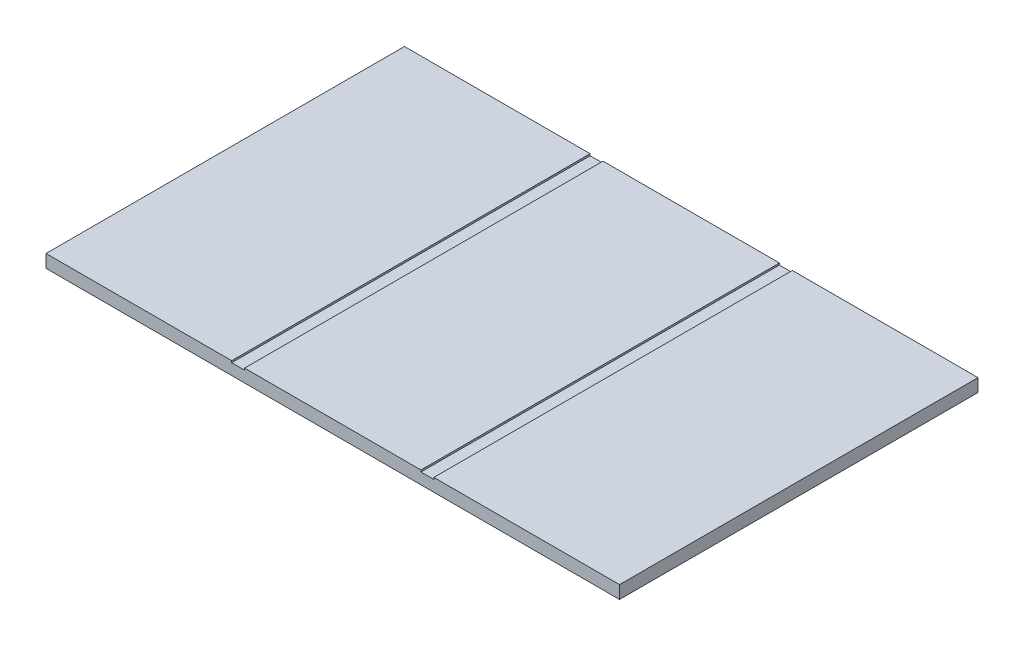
from build123d import *

# Parameters (mm, degrees)
ESBO_O1_W                = 800
ESBO_O1_H                = 500
RESSALTO_EXTRUS_O1_DEPTH = 18
ESBO_O2_W                = 18
ESBO_O2_H                = 500
CORTE_EXTRUS_O1_DEPTH    = 2.5


with BuildPart() as part:
    # Esbo_o1 → Ressalto-extrus_o1 (new body)
    with BuildSketch(Plane(origin=(0, 0, 0), x_dir=(1, 0, 0), z_dir=(0, 1, 0))):
        Rectangle(ESBO_O1_W, ESBO_O1_H)
    extrude(amount=RESSALTO_EXTRUS_O1_DEPTH)

    # Esbo_o2 → Corte-extrus_o1 (cut)
    with BuildSketch(Plane(origin=(0, 18, 0), x_dir=(1, 0, 0), z_dir=(0, 1, 0))):
        with Locations((-132, 0)):
            Rectangle(ESBO_O2_W, ESBO_O2_H)
        with Locations((132, 0)):
            Rectangle(ESBO_O2_W, ESBO_O2_H)
    extrude(amount=-CORTE_EXTRUS_O1_DEPTH, mode=Mode.SUBTRACT)


solid = part.part
